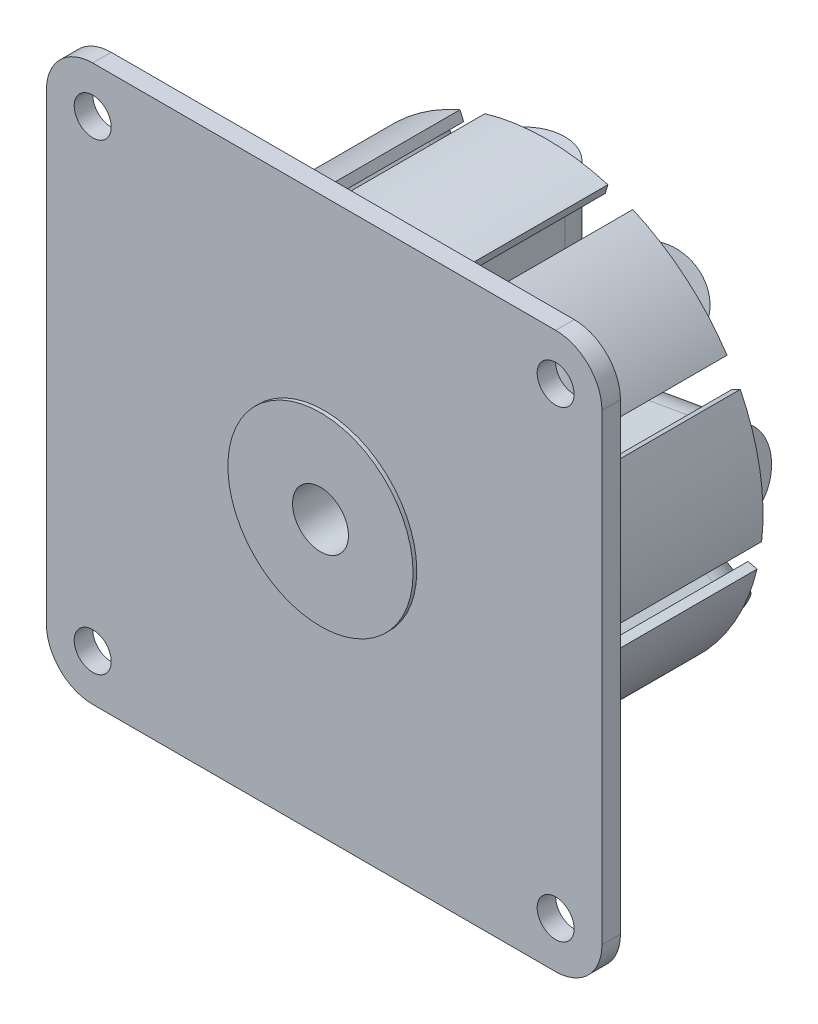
from build123d import *

# Parameters (mm, degrees)
ESQUISSE1_R                  = 6.25
ESQUISSE1_R_2                = 1.51
EXTRUSION1_DEPTH             = 12
ESQUISSE2_R                  = 1
EXTRUSION2_DEPTH             = 1
ESQUISSE3_R                  = 5
EXTRUSION3_DEPTH             = 0.2
ESQUISSE4_R                  = 1.51
ENL_V_MAT_EXTRU_1_DEPTH      = 25.471207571
EXTRUSION4_DEPTH             = 5.8
R_P_TITION_CIRCULAIRE1_COUNT = 9
EXTRUSION5_DEPTH             = 9
R_P_TITION_CIRCULAIRE2_COUNT = 9


with BuildPart() as part:
    # Esquisse1 → Extrusion1 (new body)
    with BuildSketch(Plane.XY):
        Circle(ESQUISSE1_R)
        Circle(ESQUISSE1_R_2, mode=Mode.SUBTRACT)
    extrude(amount=-EXTRUSION1_DEPTH)

    # Esquisse2 → Extrusion2 (add)
    with BuildSketch(Plane.XY):
        with BuildLine():
            Line((-12.5, 15), (12.5, 15))
            ThreePointArc((12.5, 15), (14.267766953, 14.267766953), (15, 12.5))
            Line((15, 12.5), (15, -12.5))
            ThreePointArc((15, -12.5), (14.267766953, -14.267766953), (12.5, -15))
            Line((12.5, -15), (-12.5, -15))
            ThreePointArc((-12.5, -15), (-14.267766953, -14.267766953), (-15, -12.5))
            Line((-15, -12.5), (-15, 12.5))
            ThreePointArc((-15, 12.5), (-14.267766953, 14.267766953), (-12.5, 15))
        make_face()
        with Locations((12.5, 12.5)):
            Circle(ESQUISSE2_R, mode=Mode.SUBTRACT)
        with Locations((-12.5, 12.5)):
            Circle(ESQUISSE2_R, mode=Mode.SUBTRACT)
        with Locations((-12.5, -12.5)):
            Circle(ESQUISSE2_R, mode=Mode.SUBTRACT)
        with Locations((12.5, -12.5)):
            Circle(ESQUISSE2_R, mode=Mode.SUBTRACT)
    extrude(amount=-EXTRUSION2_DEPTH)

    # Esquisse3 → Extrusion3 (add)
    with BuildSketch(Plane.XY):
        Circle(ESQUISSE3_R)
    extrude(amount=EXTRUSION3_DEPTH)

    # Esquisse4 → Enl_v. mat.-Extru.1 (cut, through all)
    with BuildSketch(Plane.XY.offset(0.2)):
        Circle(ESQUISSE4_R)
    extrude(amount=-ENL_V_MAT_EXTRU_1_DEPTH, mode=Mode.SUBTRACT)

    # Esquisse5 → Extrusion4 (add)
    with BuildSketch(Plane(origin=(0, 5.5, 0), x_dir=(-1, 0, 0), z_dir=(0, 1, 0))):
        with BuildLine():
            Line((-0.01, -2), (0.01, -2))
            ThreePointArc((0.01, -2), (1.558563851, -2.641436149), (2.2, -4.19))
            Line((2.2, -4.19), (2.2, -10.81))
            ThreePointArc((2.2, -10.81), (1.558563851, -12.358563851), (0.01, -13))
            Line((0.01, -13), (-0.01, -13))
            ThreePointArc((-0.01, -13), (-1.558563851, -12.358563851), (-2.2, -10.81))
            Line((-2.2, -10.81), (-2.2, -4.19))
            ThreePointArc((-2.2, -4.19), (-1.558563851, -2.641436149), (-0.01, -2))
        make_face()
    extrusion4 = extrude(amount=EXTRUSION4_DEPTH)

    # R_p_tition circulaire1: Extrusion4 ×9 about axis
    r_p_tition_circulaire1_axis = Axis((0, 0, 0), (0, 0, 1))
    for i in range(1, R_P_TITION_CIRCULAIRE1_COUNT):
        add(extrusion4.rotate(r_p_tition_circulaire1_axis, i * 360 / R_P_TITION_CIRCULAIRE1_COUNT))

    # Esquisse6 → Extrusion5 (add)
    with BuildSketch(Plane(origin=(0, 0, -12), x_dir=(-1, 0, 0), z_dir=(0, 0, -1))):
        with BuildLine():
            Line((-3.179820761, 10.739121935), (-3.321777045, 11.218547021))
            ThreePointArc((-3.321777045, 11.218547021), (0, 11.7), (3.321777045, 11.218547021))
            Line((3.321777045, 11.218547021), (3.179820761, 10.739121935))
            ThreePointArc((3.179820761, 10.739121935), (0, 11.2), (-3.179820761, 10.739121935))
        make_face()
    extrusion5 = extrude(amount=-EXTRUSION5_DEPTH)

    # R_p_tition circulaire2: Extrusion5 ×9 about axis
    r_p_tition_circulaire2_axis = Axis((0, 0, 0), (0, 0, 1))
    for i in range(1, R_P_TITION_CIRCULAIRE2_COUNT):
        add(extrusion5.rotate(r_p_tition_circulaire2_axis, i * 360 / R_P_TITION_CIRCULAIRE2_COUNT))


solid = part.part
